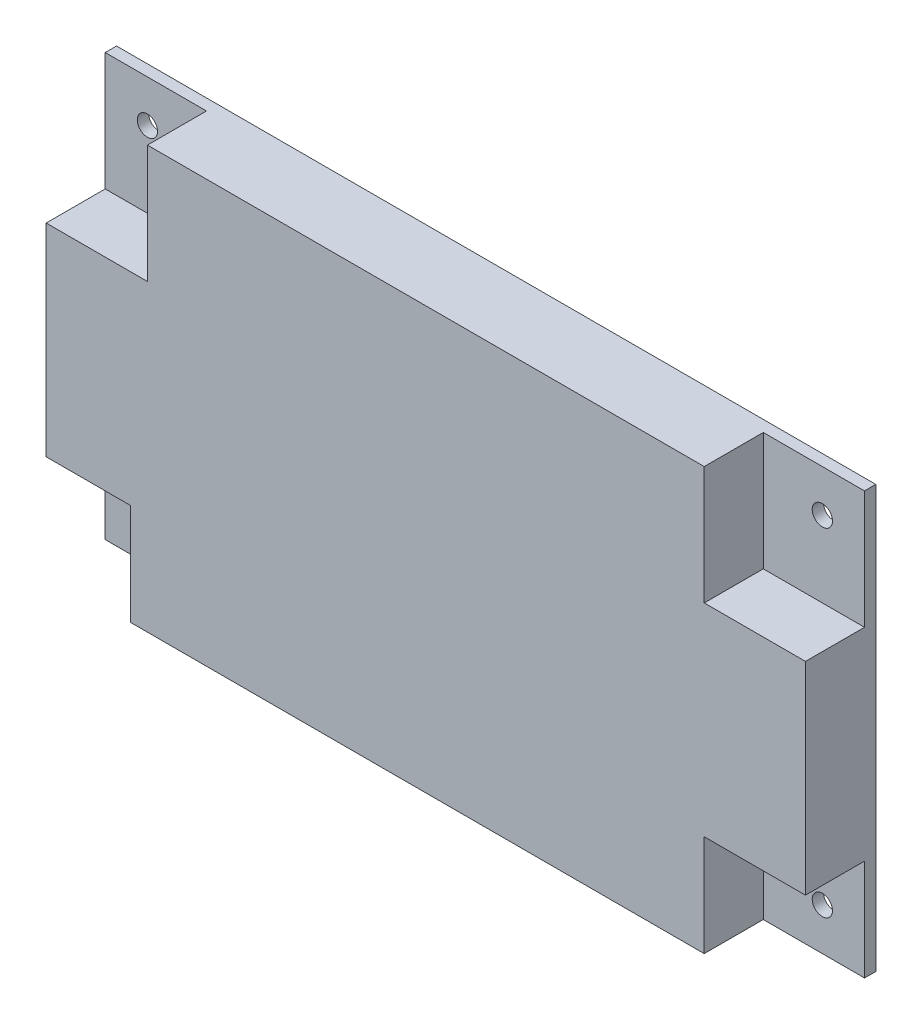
from build123d import *

# Parameters (mm, degrees)
SKETCH1_W           = 114.3
SKETCH1_H           = 63.5
SKETCH1_R           = 1.524
BASE_EXTRUDE_DEPTH  = 1.7018
BOSS_EXTRUDE1_DEPTH = 8.89


with BuildPart() as part:
    # Sketch1 → Base-Extrude (new body)
    with BuildSketch(Plane.XY):
        with Locations((57.15, 31.75)):
            Rectangle(SKETCH1_W, SKETCH1_H)
        with Locations((6.35, 57.15)):
            Circle(SKETCH1_R, mode=Mode.SUBTRACT)
        with Locations((107.95, 57.15)):
            Circle(SKETCH1_R, mode=Mode.SUBTRACT)
        with Locations((107.95, 6.35)):
            Circle(SKETCH1_R, mode=Mode.SUBTRACT)
        with Locations((6.35, 6.35)):
            Circle(SKETCH1_R, mode=Mode.SUBTRACT)
    extrude(amount=BASE_EXTRUDE_DEPTH)

    # Sketch2 → Boss-Extrude1 (add)
    with BuildSketch(Plane.XY.offset(1.7018)):
        Polygon((114.3, 15.24), (99.06, 15.24), (99.06, 0), (12.7, 0), (12.7, 15.24), (0, 15.24), (0, 45.72), (15.24, 45.72), (15.24, 63.5), (99.06, 63.5), (99.06, 45.72), (114.3, 45.72), align=None)
    extrude(amount=BOSS_EXTRUDE1_DEPTH)


solid = part.part
